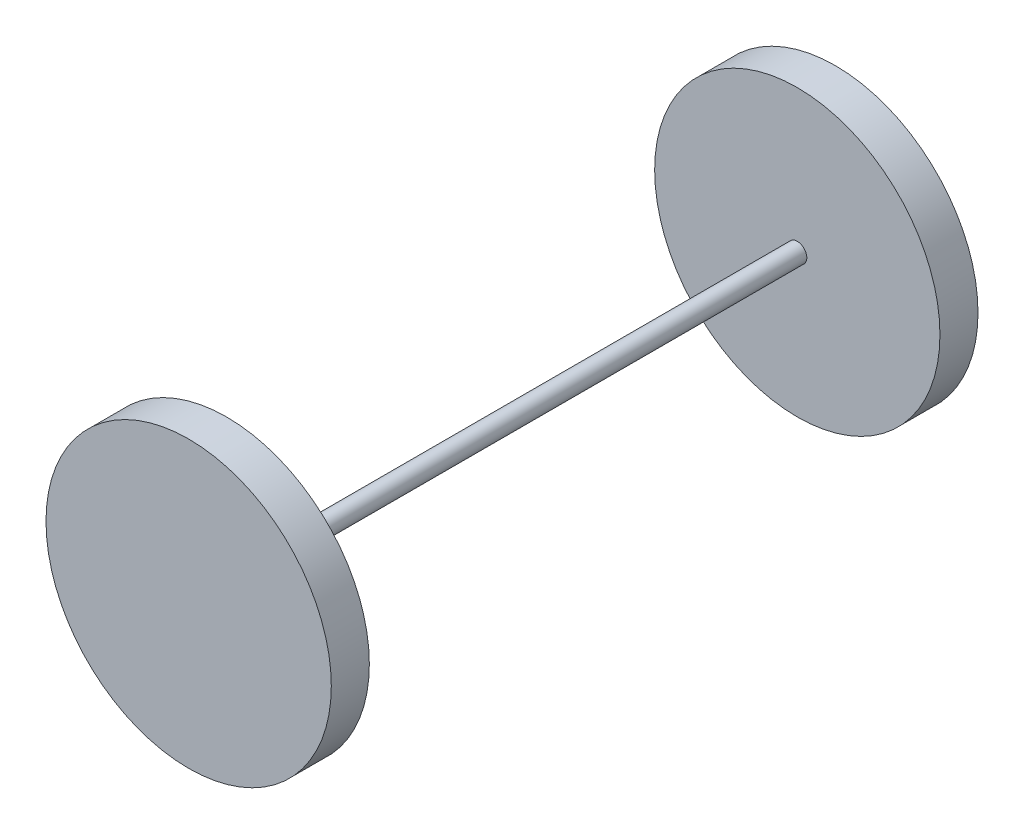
ISO-10303-21;
HEADER;
FILE_DESCRIPTION(('STEP AP214'),'2;1');
FILE_NAME('part.step','',(''),(''),'','','');
FILE_SCHEMA(('AUTOMOTIVE_DESIGN { 1 0 10303 214 1 1 1 1 }'));
ENDSEC;
DATA;
#1=APPLICATION_CONTEXT('core data for automotive mechanical design processes');
#2=APPLICATION_PROTOCOL_DEFINITION('international standard','automotive_design',2000,#1);
#3=PRODUCT_CONTEXT('',#1,'mechanical');
#4=PRODUCT('Part','Part','',(#3));
#5=PRODUCT_RELATED_PRODUCT_CATEGORY('part','',(#4));
#6=PRODUCT_DEFINITION_FORMATION('','',#4);
#7=PRODUCT_DEFINITION_CONTEXT('part definition',#1,'design');
#8=PRODUCT_DEFINITION('design','',#6,#7);
#9=PRODUCT_DEFINITION_SHAPE('','',#8);
#10=(LENGTH_UNIT() NAMED_UNIT(*) SI_UNIT(.MILLI.,.METRE.));
#11=(NAMED_UNIT(*) PLANE_ANGLE_UNIT() SI_UNIT($,.RADIAN.));
#12=(NAMED_UNIT(*) SI_UNIT($,.STERADIAN.) SOLID_ANGLE_UNIT());
#13=UNCERTAINTY_MEASURE_WITH_UNIT(LENGTH_MEASURE(1.E-05),#10,'distance_accuracy_value','');
#14=(GEOMETRIC_REPRESENTATION_CONTEXT(3) GLOBAL_UNCERTAINTY_ASSIGNED_CONTEXT((#13)) GLOBAL_UNIT_ASSIGNED_CONTEXT((#10,
#11,#12)) REPRESENTATION_CONTEXT('',''));
#15=CARTESIAN_POINT('',(0.,0.,0.));
#16=DIRECTION('',(0.,0.,1.));
#17=DIRECTION('',(1.,0.,0.));
#18=AXIS2_PLACEMENT_3D('',#15,#16,#17);
#19=CARTESIAN_POINT('',(0.,0.,20.));
#20=DIRECTION('',(0.,0.,1.));
#21=DIRECTION('',(1.,0.,0.));
#22=AXIS2_PLACEMENT_3D('',#19,#20,#21);
#23=PLANE('',#22);
#24=CARTESIAN_POINT('',(0.,0.,20.));
#25=DIRECTION('',(0.,0.,1.));
#26=DIRECTION('',(1.,0.,0.));
#27=AXIS2_PLACEMENT_3D('',#24,#25,#26);
#28=CIRCLE('',#27,75.);
#29=CARTESIAN_POINT('',(75.,0.,20.));
#30=VERTEX_POINT('',#29);
#31=EDGE_CURVE('E10',#30,#30,#28,.T.);
#32=ORIENTED_EDGE('',*,*,#31,.T.);
#33=EDGE_LOOP('',(#32));
#34=FACE_BOUND('',#33,.T.);
#35=CARTESIAN_POINT('',(0.,0.,20.));
#36=DIRECTION('',(0.,0.,1.));
#37=DIRECTION('',(1.,0.,0.));
#38=AXIS2_PLACEMENT_3D('',#35,#36,#37);
#39=CIRCLE('',#38,5.);
#40=CARTESIAN_POINT('',(5.,0.,20.));
#41=VERTEX_POINT('',#40);
#42=EDGE_CURVE('E49',#41,#41,#39,.T.);
#43=ORIENTED_EDGE('',*,*,#42,.F.);
#44=EDGE_LOOP('',(#43));
#45=FACE_BOUND('',#44,.T.);
#46=ADVANCED_FACE('F36',(#34,#45),#23,.T.);
#47=CARTESIAN_POINT('',(0.,0.,20.));
#48=DIRECTION('',(0.,0.,-1.));
#49=DIRECTION('',(-1.,0.,0.));
#50=AXIS2_PLACEMENT_3D('',#47,#48,#49);
#51=CYLINDRICAL_SURFACE('',#50,75.);
#52=ORIENTED_EDGE('',*,*,#31,.F.);
#53=EDGE_LOOP('',(#52));
#54=FACE_BOUND('',#53,.T.);
#55=CARTESIAN_POINT('',(0.,0.,0.));
#56=DIRECTION('',(0.,0.,1.));
#57=DIRECTION('',(1.,0.,0.));
#58=AXIS2_PLACEMENT_3D('',#55,#56,#57);
#59=CIRCLE('',#58,75.);
#60=CARTESIAN_POINT('',(75.,0.,0.));
#61=VERTEX_POINT('',#60);
#62=EDGE_CURVE('E40',#61,#61,#59,.T.);
#63=ORIENTED_EDGE('',*,*,#62,.T.);
#64=EDGE_LOOP('',(#63));
#65=FACE_BOUND('',#64,.T.);
#66=ADVANCED_FACE('F38',(#54,#65),#51,.T.);
#67=CARTESIAN_POINT('',(0.,0.,0.));
#68=DIRECTION('',(0.,0.,1.));
#69=DIRECTION('',(1.,0.,0.));
#70=AXIS2_PLACEMENT_3D('',#67,#68,#69);
#71=PLANE('',#70);
#72=ORIENTED_EDGE('',*,*,#62,.F.);
#73=EDGE_LOOP('',(#72));
#74=FACE_BOUND('',#73,.T.);
#75=ADVANCED_FACE('F78',(#74),#71,.F.);
#76=CARTESIAN_POINT('',(0.,0.,320.));
#77=DIRECTION('',(0.,0.,-1.));
#78=DIRECTION('',(-1.,0.,0.));
#79=AXIS2_PLACEMENT_3D('',#76,#77,#78);
#80=CYLINDRICAL_SURFACE('',#79,5.);
#81=CARTESIAN_POINT('',(0.,0.,320.));
#82=DIRECTION('',(0.,0.,1.));
#83=DIRECTION('',(1.,0.,0.));
#84=AXIS2_PLACEMENT_3D('',#81,#82,#83);
#85=CIRCLE('',#84,5.);
#86=CARTESIAN_POINT('',(5.,0.,320.));
#87=VERTEX_POINT('',#86);
#88=EDGE_CURVE('E47',#87,#87,#85,.T.);
#89=ORIENTED_EDGE('',*,*,#88,.F.);
#90=EDGE_LOOP('',(#89));
#91=FACE_BOUND('',#90,.T.);
#92=ORIENTED_EDGE('',*,*,#42,.T.);
#93=EDGE_LOOP('',(#92));
#94=FACE_BOUND('',#93,.T.);
#95=ADVANCED_FACE('F72',(#91,#94),#80,.T.);
#96=CARTESIAN_POINT('',(0.,0.,320.));
#97=DIRECTION('',(0.,0.,1.));
#98=DIRECTION('',(1.,0.,0.));
#99=AXIS2_PLACEMENT_3D('',#96,#97,#98);
#100=PLANE('',#99);
#101=CARTESIAN_POINT('',(0.,0.,320.));
#102=DIRECTION('',(0.,0.,1.));
#103=DIRECTION('',(1.,0.,0.));
#104=AXIS2_PLACEMENT_3D('',#101,#102,#103);
#105=CIRCLE('',#104,75.);
#106=CARTESIAN_POINT('',(75.,0.,320.));
#107=VERTEX_POINT('',#106);
#108=EDGE_CURVE('E55',#107,#107,#105,.T.);
#109=ORIENTED_EDGE('',*,*,#108,.F.);
#110=EDGE_LOOP('',(#109));
#111=FACE_BOUND('',#110,.T.);
#112=ORIENTED_EDGE('',*,*,#88,.T.);
#113=EDGE_LOOP('',(#112));
#114=FACE_BOUND('',#113,.T.);
#115=ADVANCED_FACE('F66',(#111,#114),#100,.F.);
#116=CARTESIAN_POINT('',(0.,0.,340.));
#117=DIRECTION('',(0.,0.,-1.));
#118=DIRECTION('',(-1.,0.,0.));
#119=AXIS2_PLACEMENT_3D('',#116,#117,#118);
#120=CYLINDRICAL_SURFACE('',#119,75.);
#121=CARTESIAN_POINT('',(0.,0.,340.));
#122=DIRECTION('',(0.,0.,1.));
#123=DIRECTION('',(1.,0.,0.));
#124=AXIS2_PLACEMENT_3D('',#121,#122,#123);
#125=CIRCLE('',#124,75.);
#126=CARTESIAN_POINT('',(75.,0.,340.));
#127=VERTEX_POINT('',#126);
#128=EDGE_CURVE('E52',#127,#127,#125,.T.);
#129=ORIENTED_EDGE('',*,*,#128,.F.);
#130=EDGE_LOOP('',(#129));
#131=FACE_BOUND('',#130,.T.);
#132=ORIENTED_EDGE('',*,*,#108,.T.);
#133=EDGE_LOOP('',(#132));
#134=FACE_BOUND('',#133,.T.);
#135=ADVANCED_FACE('F63',(#131,#134),#120,.T.);
#136=CARTESIAN_POINT('',(0.,0.,340.));
#137=DIRECTION('',(0.,0.,1.));
#138=DIRECTION('',(1.,0.,0.));
#139=AXIS2_PLACEMENT_3D('',#136,#137,#138);
#140=PLANE('',#139);
#141=ORIENTED_EDGE('',*,*,#128,.T.);
#142=EDGE_LOOP('',(#141));
#143=FACE_BOUND('',#142,.T.);
#144=ADVANCED_FACE('F61',(#143),#140,.T.);
#145=CLOSED_SHELL('',(#46,#66,#75,#95,#115,#135,#144));
#146=MANIFOLD_SOLID_BREP('B2',#145);
#147=ADVANCED_BREP_SHAPE_REPRESENTATION('',(#18,#146),#14);
#148=SHAPE_DEFINITION_REPRESENTATION(#9,#147);
ENDSEC;
END-ISO-10303-21;
